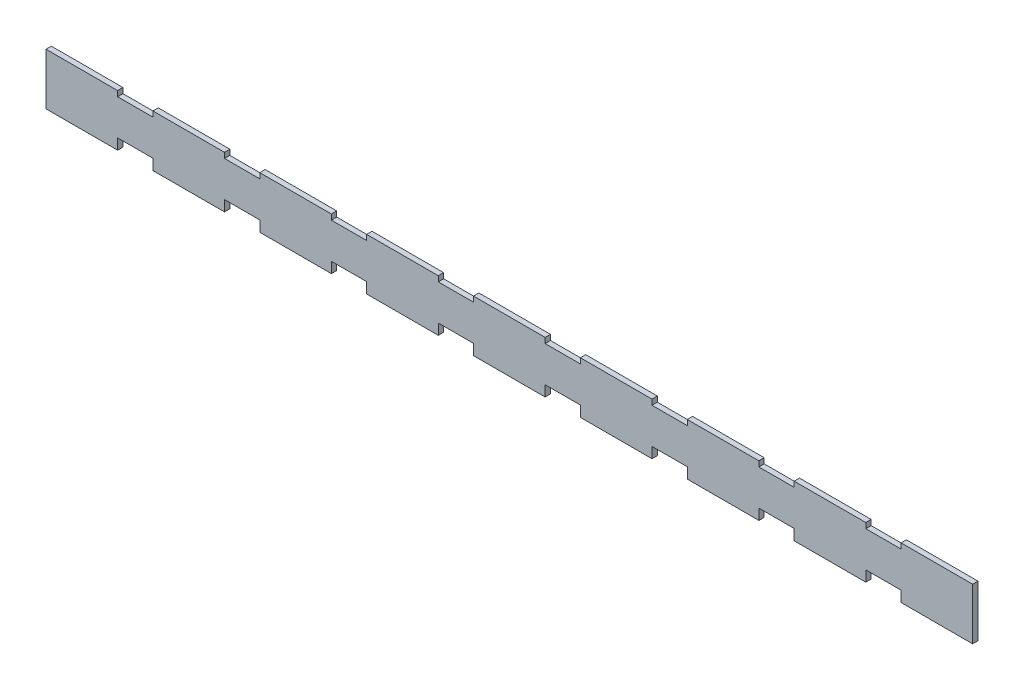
from build123d import *

# Parameters (mm, degrees)
BOSS_EXTRUDE1_DEPTH = 3


with BuildPart() as part:
    # Sketch1 → Boss-Extrude1 (new body)
    with BuildSketch(Plane.XY):
        Polygon((219.9, -10), (200.1, -10), (200.1, -16), (159.9, -16), (159.9, -10), (140.1, -10), (140.1, -16), (99.9, -16), (99.9, -10), (80.1, -10), (80.1, -16), (39.9, -16), (39.9, -10), (20.1, -10), (20.1, -16), (-20.1, -16), (-20.1, -10), (-39.9, -10), (-39.9, -16), (-80.1, -16), (-80.1, -10), (-99.9, -10), (-99.9, -16), (-140.1, -16), (-140.1, -10), (-159.9, -10), (-159.9, -16), (-200.1, -16), (-200.1, -10), (-219.9, -10), (-219.9, -16), (-260.1, -16), (-260.1, -10), (-260.1, 10), (-260.1, 13), (-219.9, 13), (-219.9, 10), (-200.1, 10), (-200.1, 13), (-159.9, 13), (-159.9, 10), (-140.1, 10), (-140.1, 13), (-99.9, 13), (-99.9, 10), (-80.1, 10), (-80.1, 13), (-39.9, 13), (-39.9, 10), (-20.1, 10), (-20.1, 13), (20.1, 13), (20.1, 10), (39.9, 10), (39.9, 13), (80.1, 13), (80.1, 10), (99.9, 10), (99.9, 13), (140.1, 13), (140.1, 10), (159.9, 10), (159.9, 13), (200.1, 13), (200.1, 10), (219.9, 10), (219.9, 13), (260.1, 13), (260.1, 10), (260.1, -10), (260.1, -16), (219.9, -16), align=None)
    extrude(amount=BOSS_EXTRUDE1_DEPTH)


solid = part.part
